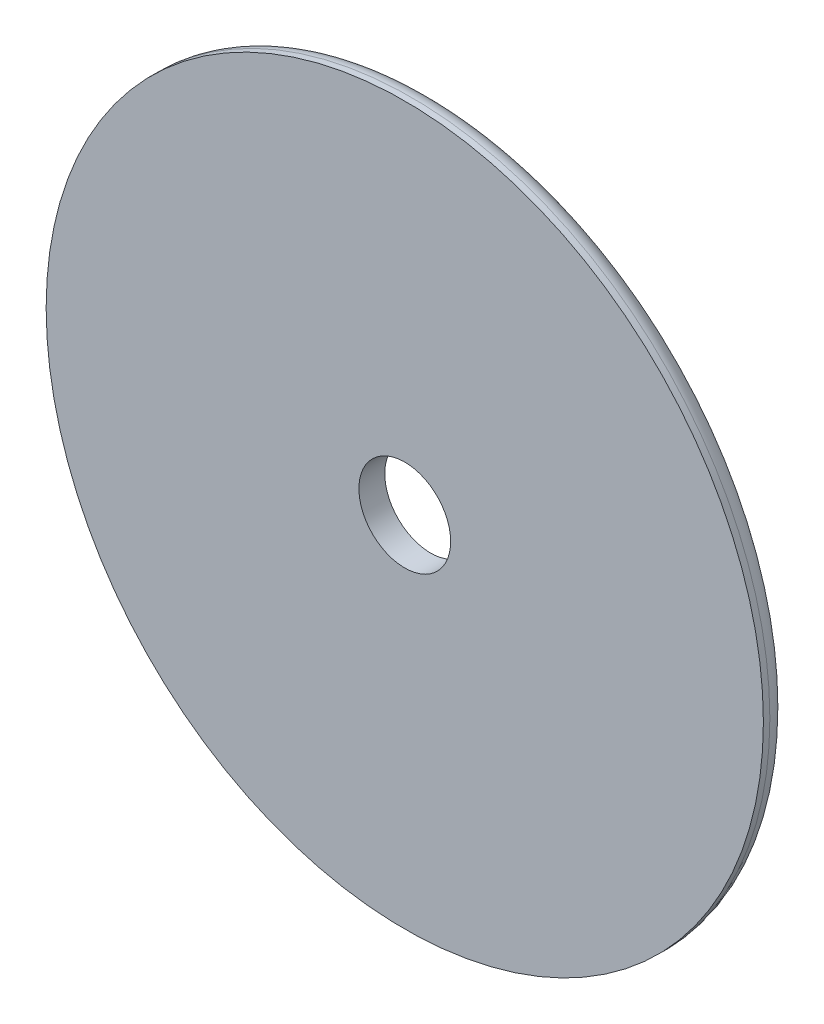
ISO-10303-21;
HEADER;
FILE_DESCRIPTION(('STEP AP214'),'2;1');
FILE_NAME('part.step','',(''),(''),'','','');
FILE_SCHEMA(('AUTOMOTIVE_DESIGN { 1 0 10303 214 1 1 1 1 }'));
ENDSEC;
DATA;
#1=APPLICATION_CONTEXT('core data for automotive mechanical design processes');
#2=APPLICATION_PROTOCOL_DEFINITION('international standard','automotive_design',2000,#1);
#3=PRODUCT_CONTEXT('',#1,'mechanical');
#4=PRODUCT('Part','Part','',(#3));
#5=PRODUCT_RELATED_PRODUCT_CATEGORY('part','',(#4));
#6=PRODUCT_DEFINITION_FORMATION('','',#4);
#7=PRODUCT_DEFINITION_CONTEXT('part definition',#1,'design');
#8=PRODUCT_DEFINITION('design','',#6,#7);
#9=PRODUCT_DEFINITION_SHAPE('','',#8);
#10=(LENGTH_UNIT() NAMED_UNIT(*) SI_UNIT(.MILLI.,.METRE.));
#11=(NAMED_UNIT(*) PLANE_ANGLE_UNIT() SI_UNIT($,.RADIAN.));
#12=(NAMED_UNIT(*) SI_UNIT($,.STERADIAN.) SOLID_ANGLE_UNIT());
#13=UNCERTAINTY_MEASURE_WITH_UNIT(LENGTH_MEASURE(1.E-05),#10,'distance_accuracy_value','');
#14=(GEOMETRIC_REPRESENTATION_CONTEXT(3) GLOBAL_UNCERTAINTY_ASSIGNED_CONTEXT((#13)) GLOBAL_UNIT_ASSIGNED_CONTEXT((#10,
#11,#12)) REPRESENTATION_CONTEXT('',''));
#15=CARTESIAN_POINT('',(0.,0.,0.));
#16=DIRECTION('',(0.,0.,1.));
#17=DIRECTION('',(1.,0.,0.));
#18=AXIS2_PLACEMENT_3D('',#15,#16,#17);
#19=CARTESIAN_POINT('',(0.,0.,4.00000000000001));
#20=DIRECTION('',(0.,0.,1.));
#21=DIRECTION('',(0.999999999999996,0.,0.));
#22=AXIS2_PLACEMENT_3D('',#19,#20,#21);
#23=PLANE('',#22);
#24=CARTESIAN_POINT('',(0.,0.,4.00000000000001));
#25=DIRECTION('',(0.,0.,1.));
#26=DIRECTION('',(0.999999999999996,0.,0.));
#27=AXIS2_PLACEMENT_3D('',#24,#25,#26);
#28=CIRCLE('',#27,55.5);
#29=CARTESIAN_POINT('',(55.4999999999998,0.,4.00000000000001));
#30=VERTEX_POINT('',#29);
#31=EDGE_CURVE('E39',#30,#30,#28,.T.);
#32=ORIENTED_EDGE('',*,*,#31,.T.);
#33=EDGE_LOOP('',(#32));
#34=FACE_BOUND('',#33,.T.);
#35=CARTESIAN_POINT('',(0.,0.,4.00000000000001));
#36=DIRECTION('',(0.,0.,1.));
#37=DIRECTION('',(0.999999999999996,0.,0.));
#38=AXIS2_PLACEMENT_3D('',#35,#36,#37);
#39=CIRCLE('',#38,7.1);
#40=CARTESIAN_POINT('',(7.09999999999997,0.,4.00000000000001));
#41=VERTEX_POINT('',#40);
#42=EDGE_CURVE('E43',#41,#41,#39,.T.);
#43=ORIENTED_EDGE('',*,*,#42,.F.);
#44=EDGE_LOOP('',(#43));
#45=FACE_BOUND('',#44,.T.);
#46=ADVANCED_FACE('F28',(#34,#45),#23,.T.);
#47=CARTESIAN_POINT('',(0.,0.,0.));
#48=DIRECTION('',(0.,0.,1.));
#49=DIRECTION('',(0.999999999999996,0.,0.));
#50=AXIS2_PLACEMENT_3D('',#47,#48,#49);
#51=PLANE('',#50);
#52=CARTESIAN_POINT('',(0.,0.,0.));
#53=DIRECTION('',(0.,0.,1.));
#54=DIRECTION('',(0.999999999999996,0.,0.));
#55=AXIS2_PLACEMENT_3D('',#52,#53,#54);
#56=CIRCLE('',#55,52.5);
#57=CARTESIAN_POINT('',(52.4999999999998,0.,0.));
#58=VERTEX_POINT('',#57);
#59=EDGE_CURVE('E10',#58,#58,#56,.F.);
#60=ORIENTED_EDGE('',*,*,#59,.T.);
#61=EDGE_LOOP('',(#60));
#62=FACE_BOUND('',#61,.T.);
#63=CARTESIAN_POINT('',(0.,0.,0.));
#64=DIRECTION('',(0.,0.,1.));
#65=DIRECTION('',(0.999999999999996,0.,0.));
#66=AXIS2_PLACEMENT_3D('',#63,#64,#65);
#67=CIRCLE('',#66,7.1);
#68=CARTESIAN_POINT('',(7.09999999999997,0.,0.));
#69=VERTEX_POINT('',#68);
#70=EDGE_CURVE('E48',#69,#69,#67,.T.);
#71=ORIENTED_EDGE('',*,*,#70,.T.);
#72=EDGE_LOOP('',(#71));
#73=FACE_BOUND('',#72,.T.);
#74=ADVANCED_FACE('F52',(#62,#73),#51,.F.);
#75=CARTESIAN_POINT('',(0.,0.,4.00000000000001));
#76=DIRECTION('',(0.,0.,-1.));
#77=DIRECTION('',(-0.999999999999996,0.,0.));
#78=AXIS2_PLACEMENT_3D('',#75,#76,#77);
#79=CYLINDRICAL_SURFACE('',#78,55.5);
#80=CARTESIAN_POINT('',(0.,0.,3.00000000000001));
#81=DIRECTION('',(0.,0.,1.));
#82=DIRECTION('',(0.999999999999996,0.,0.));
#83=AXIS2_PLACEMENT_3D('',#80,#81,#82);
#84=CIRCLE('',#83,55.5);
#85=CARTESIAN_POINT('',(55.4999999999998,0.,3.00000000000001));
#86=VERTEX_POINT('',#85);
#87=EDGE_CURVE('E35',#86,#86,#84,.T.);
#88=ORIENTED_EDGE('',*,*,#87,.T.);
#89=EDGE_LOOP('',(#88));
#90=FACE_BOUND('',#89,.T.);
#91=ORIENTED_EDGE('',*,*,#31,.F.);
#92=EDGE_LOOP('',(#91));
#93=FACE_BOUND('',#92,.T.);
#94=ADVANCED_FACE('F30',(#90,#93),#79,.T.);
#95=CARTESIAN_POINT('',(0.,0.,4.00000000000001));
#96=DIRECTION('',(0.,0.,-1.));
#97=DIRECTION('',(-0.999999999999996,0.,0.));
#98=AXIS2_PLACEMENT_3D('',#95,#96,#97);
#99=CYLINDRICAL_SURFACE('',#98,7.1);
#100=ORIENTED_EDGE('',*,*,#42,.T.);
#101=EDGE_LOOP('',(#100));
#102=FACE_BOUND('',#101,.T.);
#103=ORIENTED_EDGE('',*,*,#70,.F.);
#104=EDGE_LOOP('',(#103));
#105=FACE_BOUND('',#104,.T.);
#106=ADVANCED_FACE('F54',(#102,#105),#99,.F.);
#107=CARTESIAN_POINT('',(0.,0.,3.00000000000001));
#108=DIRECTION('',(0.,0.,1.));
#109=DIRECTION('',(0.999999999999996,0.,0.));
#110=AXIS2_PLACEMENT_3D('',#107,#108,#109);
#111=TOROIDAL_SURFACE('',#110,52.5,3.);
#112=ORIENTED_EDGE('',*,*,#59,.F.);
#113=EDGE_LOOP('',(#112));
#114=FACE_BOUND('',#113,.T.);
#115=ORIENTED_EDGE('',*,*,#87,.F.);
#116=EDGE_LOOP('',(#115));
#117=FACE_BOUND('',#116,.T.);
#118=ADVANCED_FACE('F56',(#114,#117),#111,.T.);
#119=CLOSED_SHELL('',(#46,#74,#94,#106,#118));
#120=MANIFOLD_SOLID_BREP('B2',#119);
#121=ADVANCED_BREP_SHAPE_REPRESENTATION('',(#18,#120),#14);
#122=SHAPE_DEFINITION_REPRESENTATION(#9,#121);
ENDSEC;
END-ISO-10303-21;
